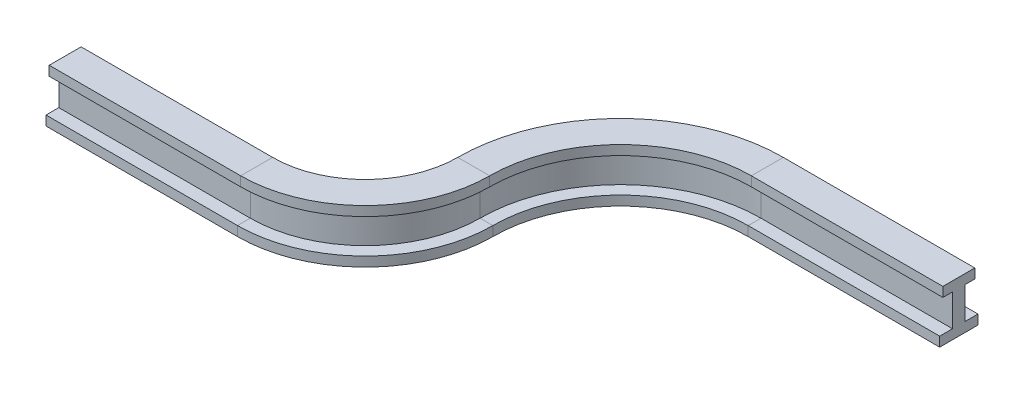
ISO-10303-21;
HEADER;
FILE_DESCRIPTION(('STEP AP214'),'2;1');
FILE_NAME('part.step','',(''),(''),'','','');
FILE_SCHEMA(('AUTOMOTIVE_DESIGN { 1 0 10303 214 1 1 1 1 }'));
ENDSEC;
DATA;
#1=APPLICATION_CONTEXT('core data for automotive mechanical design processes');
#2=APPLICATION_PROTOCOL_DEFINITION('international standard','automotive_design',2000,#1);
#3=PRODUCT_CONTEXT('',#1,'mechanical');
#4=PRODUCT('Part','Part','',(#3));
#5=PRODUCT_RELATED_PRODUCT_CATEGORY('part','',(#4));
#6=PRODUCT_DEFINITION_FORMATION('','',#4);
#7=PRODUCT_DEFINITION_CONTEXT('part definition',#1,'design');
#8=PRODUCT_DEFINITION('design','',#6,#7);
#9=PRODUCT_DEFINITION_SHAPE('','',#8);
#10=(LENGTH_UNIT() NAMED_UNIT(*) SI_UNIT(.MILLI.,.METRE.));
#11=(NAMED_UNIT(*) PLANE_ANGLE_UNIT() SI_UNIT($,.RADIAN.));
#12=(NAMED_UNIT(*) SI_UNIT($,.STERADIAN.) SOLID_ANGLE_UNIT());
#13=UNCERTAINTY_MEASURE_WITH_UNIT(LENGTH_MEASURE(1.E-05),#10,'distance_accuracy_value','');
#14=(GEOMETRIC_REPRESENTATION_CONTEXT(3) GLOBAL_UNCERTAINTY_ASSIGNED_CONTEXT((#13)) GLOBAL_UNIT_ASSIGNED_CONTEXT((#10,
#11,#12)) REPRESENTATION_CONTEXT('',''));
#15=CARTESIAN_POINT('',(0.,0.,0.));
#16=DIRECTION('',(0.,0.,1.));
#17=DIRECTION('',(1.,0.,0.));
#18=AXIS2_PLACEMENT_3D('',#15,#16,#17);
#19=CARTESIAN_POINT('',(0.,0.,0.));
#20=DIRECTION('',(-1.,0.,0.));
#21=DIRECTION('',(0.,0.,1.));
#22=AXIS2_PLACEMENT_3D('',#19,#20,#21);
#23=PLANE('',#22);
#24=DIRECTION('',(0.,0.,-1.));
#25=VECTOR('',#24,1.);
#26=CARTESIAN_POINT('',(0.,6.5,-2.));
#27=LINE('',#26,#25);
#28=CARTESIAN_POINT('',(0.,6.5,-0.499999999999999));
#29=VERTEX_POINT('',#28);
#30=CARTESIAN_POINT('',(0.,6.5,-2.));
#31=VERTEX_POINT('',#30);
#32=EDGE_CURVE('E360',#29,#31,#27,.T.);
#33=ORIENTED_EDGE('',*,*,#32,.T.);
#34=DIRECTION('',(0.,-1.,0.));
#35=VECTOR('',#34,1.);
#36=CARTESIAN_POINT('',(0.,1.5,-2.));
#37=LINE('',#36,#35);
#38=CARTESIAN_POINT('',(0.,1.5,-2.));
#39=VERTEX_POINT('',#38);
#40=EDGE_CURVE('E358',#31,#39,#37,.T.);
#41=ORIENTED_EDGE('',*,*,#40,.T.);
#42=DIRECTION('',(0.,0.,1.));
#43=VECTOR('',#42,1.);
#44=CARTESIAN_POINT('',(0.,1.5,-2.));
#45=LINE('',#44,#43);
#46=CARTESIAN_POINT('',(0.,1.5,0.));
#47=VERTEX_POINT('',#46);
#48=EDGE_CURVE('E348',#39,#47,#45,.T.);
#49=ORIENTED_EDGE('',*,*,#48,.T.);
#50=DIRECTION('',(0.,-1.,0.));
#51=VECTOR('',#50,1.);
#52=CARTESIAN_POINT('',(0.,1.5,0.));
#53=LINE('',#52,#51);
#54=CARTESIAN_POINT('',(0.,0.,0.));
#55=VERTEX_POINT('',#54);
#56=EDGE_CURVE('E341',#47,#55,#53,.T.);
#57=ORIENTED_EDGE('',*,*,#56,.T.);
#58=DIRECTION('',(0.,0.,-1.));
#59=VECTOR('',#58,1.);
#60=CARTESIAN_POINT('',(0.,0.,0.));
#61=LINE('',#60,#59);
#62=CARTESIAN_POINT('',(0.,0.,-6.));
#63=VERTEX_POINT('',#62);
#64=EDGE_CURVE('E334',#55,#63,#61,.T.);
#65=ORIENTED_EDGE('',*,*,#64,.T.);
#66=DIRECTION('',(0.,1.,0.));
#67=VECTOR('',#66,1.);
#68=CARTESIAN_POINT('',(0.,0.,-6.));
#69=LINE('',#68,#67);
#70=CARTESIAN_POINT('',(0.,1.5,-6.));
#71=VERTEX_POINT('',#70);
#72=EDGE_CURVE('E421',#63,#71,#69,.T.);
#73=ORIENTED_EDGE('',*,*,#72,.T.);
#74=DIRECTION('',(0.,0.,1.));
#75=VECTOR('',#74,1.);
#76=CARTESIAN_POINT('',(0.,1.5,-6.));
#77=LINE('',#76,#75);
#78=CARTESIAN_POINT('',(0.,1.5,-4.));
#79=VERTEX_POINT('',#78);
#80=EDGE_CURVE('E438',#71,#79,#77,.T.);
#81=ORIENTED_EDGE('',*,*,#80,.T.);
#82=DIRECTION('',(0.,1.,0.));
#83=VECTOR('',#82,1.);
#84=CARTESIAN_POINT('',(0.,6.5,-4.));
#85=LINE('',#84,#83);
#86=CARTESIAN_POINT('',(0.,6.5,-4.));
#87=VERTEX_POINT('',#86);
#88=EDGE_CURVE('E458',#79,#87,#85,.T.);
#89=ORIENTED_EDGE('',*,*,#88,.T.);
#90=DIRECTION('',(0.,0.,-1.));
#91=VECTOR('',#90,1.);
#92=CARTESIAN_POINT('',(0.,6.5,-5.5));
#93=LINE('',#92,#91);
#94=CARTESIAN_POINT('',(0.,6.5,-5.5));
#95=VERTEX_POINT('',#94);
#96=EDGE_CURVE('E193',#87,#95,#93,.T.);
#97=ORIENTED_EDGE('',*,*,#96,.T.);
#98=DIRECTION('',(0.,1.,0.));
#99=VECTOR('',#98,1.);
#100=CARTESIAN_POINT('',(0.,8.,-5.5));
#101=LINE('',#100,#99);
#102=CARTESIAN_POINT('',(0.,8.,-5.5));
#103=VERTEX_POINT('',#102);
#104=EDGE_CURVE('E185',#95,#103,#101,.T.);
#105=ORIENTED_EDGE('',*,*,#104,.T.);
#106=DIRECTION('',(0.,0.,1.));
#107=VECTOR('',#106,1.);
#108=CARTESIAN_POINT('',(0.,8.,-0.499999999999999));
#109=LINE('',#108,#107);
#110=CARTESIAN_POINT('',(0.,8.,-0.499999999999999));
#111=VERTEX_POINT('',#110);
#112=EDGE_CURVE('E178',#103,#111,#109,.T.);
#113=ORIENTED_EDGE('',*,*,#112,.T.);
#114=DIRECTION('',(0.,-1.,0.));
#115=VECTOR('',#114,1.);
#116=CARTESIAN_POINT('',(0.,6.5,-0.499999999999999));
#117=LINE('',#116,#115);
#118=EDGE_CURVE('E540',#111,#29,#117,.T.);
#119=ORIENTED_EDGE('',*,*,#118,.T.);
#120=EDGE_LOOP('',(#33,#41,#49,#57,#65,#73,#81,#89,#97,#105,#113,#119));
#121=FACE_BOUND('',#120,.T.);
#122=ADVANCED_FACE('F32',(#121),#23,.F.);
#123=CARTESIAN_POINT('',(-100.,0.,40.));
#124=DIRECTION('',(-1.,0.,0.));
#125=DIRECTION('',(0.,0.,1.));
#126=AXIS2_PLACEMENT_3D('',#123,#124,#125);
#127=PLANE('',#126);
#128=DIRECTION('',(0.,0.,-1.));
#129=VECTOR('',#128,1.);
#130=CARTESIAN_POINT('',(-100.,6.5,38.));
#131=LINE('',#130,#129);
#132=CARTESIAN_POINT('',(-100.,6.5,39.5));
#133=VERTEX_POINT('',#132);
#134=CARTESIAN_POINT('',(-100.,6.5,38.));
#135=VERTEX_POINT('',#134);
#136=EDGE_CURVE('E46',#133,#135,#131,.T.);
#137=ORIENTED_EDGE('',*,*,#136,.F.);
#138=DIRECTION('',(0.,-1.,0.));
#139=VECTOR('',#138,1.);
#140=CARTESIAN_POINT('',(-100.,6.5,39.5));
#141=LINE('',#140,#139);
#142=CARTESIAN_POINT('',(-100.,8.,39.5));
#143=VERTEX_POINT('',#142);
#144=EDGE_CURVE('E55',#143,#133,#141,.T.);
#145=ORIENTED_EDGE('',*,*,#144,.F.);
#146=DIRECTION('',(0.,0.,1.));
#147=VECTOR('',#146,1.);
#148=CARTESIAN_POINT('',(-100.,8.,39.5));
#149=LINE('',#148,#147);
#150=CARTESIAN_POINT('',(-100.,8.,34.5));
#151=VERTEX_POINT('',#150);
#152=EDGE_CURVE('E538',#151,#143,#149,.T.);
#153=ORIENTED_EDGE('',*,*,#152,.F.);
#154=DIRECTION('',(0.,1.,0.));
#155=VECTOR('',#154,1.);
#156=CARTESIAN_POINT('',(-100.,8.,34.5));
#157=LINE('',#156,#155);
#158=CARTESIAN_POINT('',(-100.,6.5,34.5));
#159=VERTEX_POINT('',#158);
#160=EDGE_CURVE('E521',#159,#151,#157,.T.);
#161=ORIENTED_EDGE('',*,*,#160,.F.);
#162=DIRECTION('',(0.,0.,-1.));
#163=VECTOR('',#162,1.);
#164=CARTESIAN_POINT('',(-100.,6.5,34.5));
#165=LINE('',#164,#163);
#166=CARTESIAN_POINT('',(-100.,6.5,36.));
#167=VERTEX_POINT('',#166);
#168=EDGE_CURVE('E501',#167,#159,#165,.T.);
#169=ORIENTED_EDGE('',*,*,#168,.F.);
#170=DIRECTION('',(0.,1.,0.));
#171=VECTOR('',#170,1.);
#172=CARTESIAN_POINT('',(-100.,6.5,36.));
#173=LINE('',#172,#171);
#174=CARTESIAN_POINT('',(-100.,1.5,36.));
#175=VERTEX_POINT('',#174);
#176=EDGE_CURVE('E211',#175,#167,#173,.T.);
#177=ORIENTED_EDGE('',*,*,#176,.F.);
#178=DIRECTION('',(0.,0.,1.));
#179=VECTOR('',#178,1.);
#180=CARTESIAN_POINT('',(-100.,1.5,34.));
#181=LINE('',#180,#179);
#182=CARTESIAN_POINT('',(-100.,1.5,34.));
#183=VERTEX_POINT('',#182);
#184=EDGE_CURVE('E219',#183,#175,#181,.T.);
#185=ORIENTED_EDGE('',*,*,#184,.F.);
#186=DIRECTION('',(0.,1.,0.));
#187=VECTOR('',#186,1.);
#188=CARTESIAN_POINT('',(-100.,0.,34.));
#189=LINE('',#188,#187);
#190=CARTESIAN_POINT('',(-100.,0.,34.));
#191=VERTEX_POINT('',#190);
#192=EDGE_CURVE('E227',#191,#183,#189,.T.);
#193=ORIENTED_EDGE('',*,*,#192,.F.);
#194=DIRECTION('',(0.,0.,-1.));
#195=VECTOR('',#194,1.);
#196=CARTESIAN_POINT('',(-100.,0.,40.));
#197=LINE('',#196,#195);
#198=CARTESIAN_POINT('',(-100.,0.,40.));
#199=VERTEX_POINT('',#198);
#200=EDGE_CURVE('E419',#199,#191,#197,.T.);
#201=ORIENTED_EDGE('',*,*,#200,.F.);
#202=DIRECTION('',(0.,-1.,0.));
#203=VECTOR('',#202,1.);
#204=CARTESIAN_POINT('',(-100.,1.5,40.));
#205=LINE('',#204,#203);
#206=CARTESIAN_POINT('',(-100.,1.5,40.));
#207=VERTEX_POINT('',#206);
#208=EDGE_CURVE('E398',#207,#199,#205,.T.);
#209=ORIENTED_EDGE('',*,*,#208,.F.);
#210=DIRECTION('',(0.,0.,1.));
#211=VECTOR('',#210,1.);
#212=CARTESIAN_POINT('',(-100.,1.5,38.));
#213=LINE('',#212,#211);
#214=CARTESIAN_POINT('',(-100.,1.5,38.));
#215=VERTEX_POINT('',#214);
#216=EDGE_CURVE('E392',#215,#207,#213,.T.);
#217=ORIENTED_EDGE('',*,*,#216,.F.);
#218=DIRECTION('',(0.,-1.,0.));
#219=VECTOR('',#218,1.);
#220=CARTESIAN_POINT('',(-100.,1.5,38.));
#221=LINE('',#220,#219);
#222=EDGE_CURVE('E11',#135,#215,#221,.T.);
#223=ORIENTED_EDGE('',*,*,#222,.F.);
#224=EDGE_LOOP('',(#137,#145,#153,#161,#169,#177,#185,#193,#201,#209,#217,#223));
#225=FACE_BOUND('',#224,.T.);
#226=ADVANCED_FACE('F633',(#225),#127,.T.);
#227=CARTESIAN_POINT('',(0.,1.5,-2.));
#228=DIRECTION('',(0.,-1.,0.));
#229=DIRECTION('',(0.,0.,-1.));
#230=AXIS2_PLACEMENT_3D('',#227,#228,#229);
#231=PLANE('',#230);
#232=DIRECTION('',(-1.,0.,0.));
#233=VECTOR('',#232,1.);
#234=CARTESIAN_POINT('',(0.,1.5,0.));
#235=LINE('',#234,#233);
#236=CARTESIAN_POINT('',(-30.,1.5,0.));
#237=VERTEX_POINT('',#236);
#238=EDGE_CURVE('E354',#47,#237,#235,.T.);
#239=ORIENTED_EDGE('',*,*,#238,.F.);
#240=ORIENTED_EDGE('',*,*,#48,.F.);
#241=DIRECTION('',(-1.,0.,0.));
#242=VECTOR('',#241,1.);
#243=CARTESIAN_POINT('',(0.,1.5,-2.));
#244=LINE('',#243,#242);
#245=CARTESIAN_POINT('',(-30.,1.5,-2.));
#246=VERTEX_POINT('',#245);
#247=EDGE_CURVE('E353',#39,#246,#244,.T.);
#248=ORIENTED_EDGE('',*,*,#247,.T.);
#249=DIRECTION('',(0.,0.,1.));
#250=VECTOR('',#249,1.);
#251=CARTESIAN_POINT('',(-30.,1.5,-2.));
#252=LINE('',#251,#250);
#253=EDGE_CURVE('E369',#246,#237,#252,.T.);
#254=ORIENTED_EDGE('',*,*,#253,.T.);
#255=EDGE_LOOP('',(#239,#240,#248,#254));
#256=FACE_BOUND('',#255,.T.);
#257=ADVANCED_FACE('F350',(#256),#231,.F.);
#258=CARTESIAN_POINT('',(0.,1.5,0.));
#259=DIRECTION('',(0.,0.,-1.));
#260=DIRECTION('',(0.,1.,0.));
#261=AXIS2_PLACEMENT_3D('',#258,#259,#260);
#262=PLANE('',#261);
#263=DIRECTION('',(-1.,0.,0.));
#264=VECTOR('',#263,1.);
#265=CARTESIAN_POINT('',(0.,0.,0.));
#266=LINE('',#265,#264);
#267=CARTESIAN_POINT('',(-30.,0.,0.));
#268=VERTEX_POINT('',#267);
#269=EDGE_CURVE('E406',#55,#268,#266,.T.);
#270=ORIENTED_EDGE('',*,*,#269,.F.);
#271=ORIENTED_EDGE('',*,*,#56,.F.);
#272=ORIENTED_EDGE('',*,*,#238,.T.);
#273=DIRECTION('',(0.,-1.,0.));
#274=VECTOR('',#273,1.);
#275=CARTESIAN_POINT('',(-30.,1.5,0.));
#276=LINE('',#275,#274);
#277=EDGE_CURVE('E403',#237,#268,#276,.T.);
#278=ORIENTED_EDGE('',*,*,#277,.T.);
#279=EDGE_LOOP('',(#270,#271,#272,#278));
#280=FACE_BOUND('',#279,.T.);
#281=ADVANCED_FACE('F640',(#280),#262,.F.);
#282=CARTESIAN_POINT('',(0.,0.,0.));
#283=DIRECTION('',(0.,1.,0.));
#284=DIRECTION('',(0.,0.,1.));
#285=AXIS2_PLACEMENT_3D('',#282,#283,#284);
#286=PLANE('',#285);
#287=DIRECTION('',(-1.,0.,0.));
#288=VECTOR('',#287,1.);
#289=CARTESIAN_POINT('',(0.,0.,-6.));
#290=LINE('',#289,#288);
#291=CARTESIAN_POINT('',(-30.,0.,-6.));
#292=VERTEX_POINT('',#291);
#293=EDGE_CURVE('E424',#63,#292,#290,.T.);
#294=ORIENTED_EDGE('',*,*,#293,.F.);
#295=ORIENTED_EDGE('',*,*,#64,.F.);
#296=ORIENTED_EDGE('',*,*,#269,.T.);
#297=DIRECTION('',(0.,0.,-1.));
#298=VECTOR('',#297,1.);
#299=CARTESIAN_POINT('',(-30.,0.,0.));
#300=LINE('',#299,#298);
#301=EDGE_CURVE('E408',#268,#292,#300,.T.);
#302=ORIENTED_EDGE('',*,*,#301,.T.);
#303=EDGE_LOOP('',(#294,#295,#296,#302));
#304=FACE_BOUND('',#303,.T.);
#305=ADVANCED_FACE('F651',(#304),#286,.F.);
#306=CARTESIAN_POINT('',(0.,0.,-6.));
#307=DIRECTION('',(0.,0.,1.));
#308=DIRECTION('',(1.,0.,0.));
#309=AXIS2_PLACEMENT_3D('',#306,#307,#308);
#310=PLANE('',#309);
#311=DIRECTION('',(-1.,0.,0.));
#312=VECTOR('',#311,1.);
#313=CARTESIAN_POINT('',(0.,1.5,-6.));
#314=LINE('',#313,#312);
#315=CARTESIAN_POINT('',(-30.,1.5,-6.));
#316=VERTEX_POINT('',#315);
#317=EDGE_CURVE('E441',#71,#316,#314,.T.);
#318=ORIENTED_EDGE('',*,*,#317,.F.);
#319=ORIENTED_EDGE('',*,*,#72,.F.);
#320=ORIENTED_EDGE('',*,*,#293,.T.);
#321=DIRECTION('',(0.,1.,0.));
#322=VECTOR('',#321,1.);
#323=CARTESIAN_POINT('',(-30.,0.,-6.));
#324=LINE('',#323,#322);
#325=EDGE_CURVE('E427',#292,#316,#324,.T.);
#326=ORIENTED_EDGE('',*,*,#325,.T.);
#327=EDGE_LOOP('',(#318,#319,#320,#326));
#328=FACE_BOUND('',#327,.T.);
#329=ADVANCED_FACE('F656',(#328),#310,.F.);
#330=CARTESIAN_POINT('',(0.,1.5,-6.));
#331=DIRECTION('',(0.,-1.,0.));
#332=DIRECTION('',(0.,0.,-1.));
#333=AXIS2_PLACEMENT_3D('',#330,#331,#332);
#334=PLANE('',#333);
#335=DIRECTION('',(-1.,0.,0.));
#336=VECTOR('',#335,1.);
#337=CARTESIAN_POINT('',(0.,1.5,-4.));
#338=LINE('',#337,#336);
#339=CARTESIAN_POINT('',(-30.,1.5,-4.));
#340=VERTEX_POINT('',#339);
#341=EDGE_CURVE('E461',#79,#340,#338,.T.);
#342=ORIENTED_EDGE('',*,*,#341,.F.);
#343=ORIENTED_EDGE('',*,*,#80,.F.);
#344=ORIENTED_EDGE('',*,*,#317,.T.);
#345=DIRECTION('',(0.,0.,1.));
#346=VECTOR('',#345,1.);
#347=CARTESIAN_POINT('',(-30.,1.5,-6.));
#348=LINE('',#347,#346);
#349=EDGE_CURVE('E444',#316,#340,#348,.T.);
#350=ORIENTED_EDGE('',*,*,#349,.T.);
#351=EDGE_LOOP('',(#342,#343,#344,#350));
#352=FACE_BOUND('',#351,.T.);
#353=ADVANCED_FACE('F681',(#352),#334,.F.);
#354=CARTESIAN_POINT('',(0.,6.5,-4.));
#355=DIRECTION('',(0.,0.,1.));
#356=DIRECTION('',(1.,0.,0.));
#357=AXIS2_PLACEMENT_3D('',#354,#355,#356);
#358=PLANE('',#357);
#359=DIRECTION('',(-1.,0.,0.));
#360=VECTOR('',#359,1.);
#361=CARTESIAN_POINT('',(0.,6.5,-4.));
#362=LINE('',#361,#360);
#363=CARTESIAN_POINT('',(-30.,6.5,-4.));
#364=VERTEX_POINT('',#363);
#365=EDGE_CURVE('E482',#87,#364,#362,.T.);
#366=ORIENTED_EDGE('',*,*,#365,.F.);
#367=ORIENTED_EDGE('',*,*,#88,.F.);
#368=ORIENTED_EDGE('',*,*,#341,.T.);
#369=DIRECTION('',(0.,1.,0.));
#370=VECTOR('',#369,1.);
#371=CARTESIAN_POINT('',(-30.,6.5,-4.));
#372=LINE('',#371,#370);
#373=EDGE_CURVE('E464',#340,#364,#372,.T.);
#374=ORIENTED_EDGE('',*,*,#373,.T.);
#375=EDGE_LOOP('',(#366,#367,#368,#374));
#376=FACE_BOUND('',#375,.T.);
#377=ADVANCED_FACE('F695',(#376),#358,.F.);
#378=CARTESIAN_POINT('',(0.,6.5,-5.5));
#379=DIRECTION('',(0.,1.,0.));
#380=DIRECTION('',(0.,0.,1.));
#381=AXIS2_PLACEMENT_3D('',#378,#379,#380);
#382=PLANE('',#381);
#383=DIRECTION('',(-1.,0.,0.));
#384=VECTOR('',#383,1.);
#385=CARTESIAN_POINT('',(0.,6.5,-5.5));
#386=LINE('',#385,#384);
#387=CARTESIAN_POINT('',(-30.,6.5,-5.5));
#388=VERTEX_POINT('',#387);
#389=EDGE_CURVE('E505',#95,#388,#386,.T.);
#390=ORIENTED_EDGE('',*,*,#389,.F.);
#391=ORIENTED_EDGE('',*,*,#96,.F.);
#392=ORIENTED_EDGE('',*,*,#365,.T.);
#393=DIRECTION('',(0.,0.,-1.));
#394=VECTOR('',#393,1.);
#395=CARTESIAN_POINT('',(-30.,6.5,-5.5));
#396=LINE('',#395,#394);
#397=EDGE_CURVE('E484',#364,#388,#396,.T.);
#398=ORIENTED_EDGE('',*,*,#397,.T.);
#399=EDGE_LOOP('',(#390,#391,#392,#398));
#400=FACE_BOUND('',#399,.T.);
#401=ADVANCED_FACE('F710',(#400),#382,.F.);
#402=CARTESIAN_POINT('',(0.,8.,-5.5));
#403=DIRECTION('',(0.,0.,1.));
#404=DIRECTION('',(1.,0.,0.));
#405=AXIS2_PLACEMENT_3D('',#402,#403,#404);
#406=PLANE('',#405);
#407=DIRECTION('',(-1.,0.,0.));
#408=VECTOR('',#407,1.);
#409=CARTESIAN_POINT('',(0.,8.,-5.5));
#410=LINE('',#409,#408);
#411=CARTESIAN_POINT('',(-30.,8.,-5.5));
#412=VERTEX_POINT('',#411);
#413=EDGE_CURVE('E525',#103,#412,#410,.T.);
#414=ORIENTED_EDGE('',*,*,#413,.F.);
#415=ORIENTED_EDGE('',*,*,#104,.F.);
#416=ORIENTED_EDGE('',*,*,#389,.T.);
#417=DIRECTION('',(0.,1.,0.));
#418=VECTOR('',#417,1.);
#419=CARTESIAN_POINT('',(-30.,8.,-5.5));
#420=LINE('',#419,#418);
#421=EDGE_CURVE('E507',#388,#412,#420,.T.);
#422=ORIENTED_EDGE('',*,*,#421,.T.);
#423=EDGE_LOOP('',(#414,#415,#416,#422));
#424=FACE_BOUND('',#423,.T.);
#425=ADVANCED_FACE('F725',(#424),#406,.F.);
#426=CARTESIAN_POINT('',(0.,8.,-0.499999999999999));
#427=DIRECTION('',(0.,-1.,0.));
#428=DIRECTION('',(0.,0.,-1.));
#429=AXIS2_PLACEMENT_3D('',#426,#427,#428);
#430=PLANE('',#429);
#431=DIRECTION('',(-1.,0.,0.));
#432=VECTOR('',#431,1.);
#433=CARTESIAN_POINT('',(0.,8.,-0.499999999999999));
#434=LINE('',#433,#432);
#435=CARTESIAN_POINT('',(-30.,8.,-0.499999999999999));
#436=VERTEX_POINT('',#435);
#437=EDGE_CURVE('E543',#111,#436,#434,.T.);
#438=ORIENTED_EDGE('',*,*,#437,.F.);
#439=ORIENTED_EDGE('',*,*,#112,.F.);
#440=ORIENTED_EDGE('',*,*,#413,.T.);
#441=DIRECTION('',(0.,0.,1.));
#442=VECTOR('',#441,1.);
#443=CARTESIAN_POINT('',(-30.,8.,-0.499999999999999));
#444=LINE('',#443,#442);
#445=EDGE_CURVE('E527',#412,#436,#444,.T.);
#446=ORIENTED_EDGE('',*,*,#445,.T.);
#447=EDGE_LOOP('',(#438,#439,#440,#446));
#448=FACE_BOUND('',#447,.T.);
#449=ADVANCED_FACE('F739',(#448),#430,.F.);
#450=CARTESIAN_POINT('',(0.,6.5,-0.499999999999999));
#451=DIRECTION('',(0.,0.,-1.));
#452=DIRECTION('',(-1.,0.,0.));
#453=AXIS2_PLACEMENT_3D('',#450,#451,#452);
#454=PLANE('',#453);
#455=DIRECTION('',(-1.,0.,0.));
#456=VECTOR('',#455,1.);
#457=CARTESIAN_POINT('',(0.,6.5,-0.499999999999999));
#458=LINE('',#457,#456);
#459=CARTESIAN_POINT('',(-30.,6.5,-0.499999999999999));
#460=VERTEX_POINT('',#459);
#461=EDGE_CURVE('E558',#29,#460,#458,.T.);
#462=ORIENTED_EDGE('',*,*,#461,.F.);
#463=ORIENTED_EDGE('',*,*,#118,.F.);
#464=ORIENTED_EDGE('',*,*,#437,.T.);
#465=DIRECTION('',(0.,-1.,0.));
#466=VECTOR('',#465,1.);
#467=CARTESIAN_POINT('',(-30.,6.5,-0.499999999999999));
#468=LINE('',#467,#466);
#469=EDGE_CURVE('E546',#436,#460,#468,.T.);
#470=ORIENTED_EDGE('',*,*,#469,.T.);
#471=EDGE_LOOP('',(#462,#463,#464,#470));
#472=FACE_BOUND('',#471,.T.);
#473=ADVANCED_FACE('F751',(#472),#454,.F.);
#474=CARTESIAN_POINT('',(0.,6.5,-2.));
#475=DIRECTION('',(0.,1.,0.));
#476=DIRECTION('',(0.,0.,1.));
#477=AXIS2_PLACEMENT_3D('',#474,#475,#476);
#478=PLANE('',#477);
#479=DIRECTION('',(-1.,0.,0.));
#480=VECTOR('',#479,1.);
#481=CARTESIAN_POINT('',(0.,6.5,-2.));
#482=LINE('',#481,#480);
#483=CARTESIAN_POINT('',(-30.,6.5,-2.));
#484=VERTEX_POINT('',#483);
#485=EDGE_CURVE('E576',#31,#484,#482,.T.);
#486=ORIENTED_EDGE('',*,*,#485,.F.);
#487=ORIENTED_EDGE('',*,*,#32,.F.);
#488=ORIENTED_EDGE('',*,*,#461,.T.);
#489=DIRECTION('',(0.,0.,-1.));
#490=VECTOR('',#489,1.);
#491=CARTESIAN_POINT('',(-30.,6.5,-2.));
#492=LINE('',#491,#490);
#493=EDGE_CURVE('E561',#460,#484,#492,.T.);
#494=ORIENTED_EDGE('',*,*,#493,.T.);
#495=EDGE_LOOP('',(#486,#487,#488,#494));
#496=FACE_BOUND('',#495,.T.);
#497=ADVANCED_FACE('F629',(#496),#478,.F.);
#498=CARTESIAN_POINT('',(0.,1.5,-2.));
#499=DIRECTION('',(0.,0.,-1.));
#500=DIRECTION('',(-1.,0.,0.));
#501=AXIS2_PLACEMENT_3D('',#498,#499,#500);
#502=PLANE('',#501);
#503=DIRECTION('',(0.,-1.,0.));
#504=VECTOR('',#503,1.);
#505=CARTESIAN_POINT('',(-30.,1.5,-2.));
#506=LINE('',#505,#504);
#507=EDGE_CURVE('E368',#484,#246,#506,.T.);
#508=ORIENTED_EDGE('',*,*,#507,.T.);
#509=ORIENTED_EDGE('',*,*,#247,.F.);
#510=ORIENTED_EDGE('',*,*,#40,.F.);
#511=ORIENTED_EDGE('',*,*,#485,.T.);
#512=EDGE_LOOP('',(#508,#509,#510,#511));
#513=FACE_BOUND('',#512,.T.);
#514=ADVANCED_FACE('F366',(#513),#502,.F.);
#515=CARTESIAN_POINT('',(-30.,1.5,-2.));
#516=DIRECTION('',(0.,-1.,0.));
#517=DIRECTION('',(0.,0.,-1.));
#518=AXIS2_PLACEMENT_3D('',#515,#516,#517);
#519=PLANE('',#518);
#520=CARTESIAN_POINT('',(-30.,1.5,20.));
#521=DIRECTION('',(0.,1.,0.));
#522=DIRECTION('',(0.,0.,-1.));
#523=AXIS2_PLACEMENT_3D('',#520,#521,#522);
#524=CIRCLE('',#523,20.);
#525=CARTESIAN_POINT('',(-50.,1.5,20.));
#526=VERTEX_POINT('',#525);
#527=EDGE_CURVE('E316',#237,#526,#524,.T.);
#528=ORIENTED_EDGE('',*,*,#527,.F.);
#529=ORIENTED_EDGE('',*,*,#253,.F.);
#530=CARTESIAN_POINT('',(-30.,1.5,20.));
#531=DIRECTION('',(0.,1.,0.));
#532=DIRECTION('',(0.,0.,-1.));
#533=AXIS2_PLACEMENT_3D('',#530,#531,#532);
#534=CIRCLE('',#533,22.);
#535=CARTESIAN_POINT('',(-52.,1.5,20.));
#536=VERTEX_POINT('',#535);
#537=EDGE_CURVE('E376',#246,#536,#534,.T.);
#538=ORIENTED_EDGE('',*,*,#537,.T.);
#539=DIRECTION('',(1.,0.,0.));
#540=VECTOR('',#539,1.);
#541=CARTESIAN_POINT('',(-52.,1.5,20.));
#542=LINE('',#541,#540);
#543=EDGE_CURVE('E374',#536,#526,#542,.T.);
#544=ORIENTED_EDGE('',*,*,#543,.T.);
#545=EDGE_LOOP('',(#528,#529,#538,#544));
#546=FACE_BOUND('',#545,.T.);
#547=ADVANCED_FACE('F604',(#546),#519,.F.);
#548=CARTESIAN_POINT('',(-30.,0.,20.));
#549=DIRECTION('',(0.,1.,0.));
#550=DIRECTION('',(0.,0.,1.));
#551=AXIS2_PLACEMENT_3D('',#548,#549,#550);
#552=CYLINDRICAL_SURFACE('',#551,20.);
#553=CARTESIAN_POINT('',(-30.,0.,20.));
#554=DIRECTION('',(0.,1.,0.));
#555=DIRECTION('',(0.,0.,-1.));
#556=AXIS2_PLACEMENT_3D('',#553,#554,#555);
#557=CIRCLE('',#556,20.);
#558=CARTESIAN_POINT('',(-50.,0.,20.));
#559=VERTEX_POINT('',#558);
#560=EDGE_CURVE('E309',#268,#559,#557,.T.);
#561=ORIENTED_EDGE('',*,*,#560,.F.);
#562=ORIENTED_EDGE('',*,*,#277,.F.);
#563=ORIENTED_EDGE('',*,*,#527,.T.);
#564=DIRECTION('',(0.,-1.,0.));
#565=VECTOR('',#564,1.);
#566=CARTESIAN_POINT('',(-50.,1.5,20.));
#567=LINE('',#566,#565);
#568=EDGE_CURVE('E378',#526,#559,#567,.T.);
#569=ORIENTED_EDGE('',*,*,#568,.T.);
#570=EDGE_LOOP('',(#561,#562,#563,#569));
#571=FACE_BOUND('',#570,.T.);
#572=ADVANCED_FACE('F649',(#571),#552,.F.);
#573=CARTESIAN_POINT('',(-30.,0.,0.));
#574=DIRECTION('',(0.,1.,0.));
#575=DIRECTION('',(0.,0.,1.));
#576=AXIS2_PLACEMENT_3D('',#573,#574,#575);
#577=PLANE('',#576);
#578=CARTESIAN_POINT('',(-30.,0.,20.));
#579=DIRECTION('',(0.,1.,0.));
#580=DIRECTION('',(0.,0.,-1.));
#581=AXIS2_PLACEMENT_3D('',#578,#579,#580);
#582=CIRCLE('',#581,26.);
#583=CARTESIAN_POINT('',(-56.,0.,20.));
#584=VERTEX_POINT('',#583);
#585=EDGE_CURVE('E301',#292,#584,#582,.T.);
#586=ORIENTED_EDGE('',*,*,#585,.F.);
#587=ORIENTED_EDGE('',*,*,#301,.F.);
#588=ORIENTED_EDGE('',*,*,#560,.T.);
#589=DIRECTION('',(-1.,0.,0.));
#590=VECTOR('',#589,1.);
#591=CARTESIAN_POINT('',(-50.,0.,20.));
#592=LINE('',#591,#590);
#593=EDGE_CURVE('E411',#559,#584,#592,.T.);
#594=ORIENTED_EDGE('',*,*,#593,.T.);
#595=EDGE_LOOP('',(#586,#587,#588,#594));
#596=FACE_BOUND('',#595,.T.);
#597=ADVANCED_FACE('F663',(#596),#577,.F.);
#598=CARTESIAN_POINT('',(-30.,0.,20.));
#599=DIRECTION('',(0.,1.,0.));
#600=DIRECTION('',(0.,0.,1.));
#601=AXIS2_PLACEMENT_3D('',#598,#599,#600);
#602=CYLINDRICAL_SURFACE('',#601,26.);
#603=CARTESIAN_POINT('',(-30.,1.5,20.));
#604=DIRECTION('',(0.,1.,0.));
#605=DIRECTION('',(0.,0.,-1.));
#606=AXIS2_PLACEMENT_3D('',#603,#604,#605);
#607=CIRCLE('',#606,26.);
#608=CARTESIAN_POINT('',(-56.,1.5,20.));
#609=VERTEX_POINT('',#608);
#610=EDGE_CURVE('E447',#316,#609,#607,.T.);
#611=ORIENTED_EDGE('',*,*,#610,.F.);
#612=ORIENTED_EDGE('',*,*,#325,.F.);
#613=ORIENTED_EDGE('',*,*,#585,.T.);
#614=DIRECTION('',(0.,1.,0.));
#615=VECTOR('',#614,1.);
#616=CARTESIAN_POINT('',(-56.,0.,20.));
#617=LINE('',#616,#615);
#618=EDGE_CURVE('E430',#584,#609,#617,.T.);
#619=ORIENTED_EDGE('',*,*,#618,.T.);
#620=EDGE_LOOP('',(#611,#612,#613,#619));
#621=FACE_BOUND('',#620,.T.);
#622=ADVANCED_FACE('F672',(#621),#602,.T.);
#623=CARTESIAN_POINT('',(-30.,1.5,-6.));
#624=DIRECTION('',(0.,-1.,0.));
#625=DIRECTION('',(0.,0.,-1.));
#626=AXIS2_PLACEMENT_3D('',#623,#624,#625);
#627=PLANE('',#626);
#628=CARTESIAN_POINT('',(-30.,1.5,20.));
#629=DIRECTION('',(0.,1.,0.));
#630=DIRECTION('',(0.,0.,-1.));
#631=AXIS2_PLACEMENT_3D('',#628,#629,#630);
#632=CIRCLE('',#631,24.);
#633=CARTESIAN_POINT('',(-54.,1.5,20.));
#634=VERTEX_POINT('',#633);
#635=EDGE_CURVE('E467',#340,#634,#632,.T.);
#636=ORIENTED_EDGE('',*,*,#635,.F.);
#637=ORIENTED_EDGE('',*,*,#349,.F.);
#638=ORIENTED_EDGE('',*,*,#610,.T.);
#639=DIRECTION('',(1.,0.,0.));
#640=VECTOR('',#639,1.);
#641=CARTESIAN_POINT('',(-56.,1.5,20.));
#642=LINE('',#641,#640);
#643=EDGE_CURVE('E450',#609,#634,#642,.T.);
#644=ORIENTED_EDGE('',*,*,#643,.T.);
#645=EDGE_LOOP('',(#636,#637,#638,#644));
#646=FACE_BOUND('',#645,.T.);
#647=ADVANCED_FACE('F685',(#646),#627,.F.);
#648=CARTESIAN_POINT('',(-30.,0.,20.));
#649=DIRECTION('',(0.,1.,0.));
#650=DIRECTION('',(0.,0.,1.));
#651=AXIS2_PLACEMENT_3D('',#648,#649,#650);
#652=CYLINDRICAL_SURFACE('',#651,24.);
#653=CARTESIAN_POINT('',(-30.,6.5,20.));
#654=DIRECTION('',(0.,1.,0.));
#655=DIRECTION('',(0.,0.,-1.));
#656=AXIS2_PLACEMENT_3D('',#653,#654,#655);
#657=CIRCLE('',#656,24.);
#658=CARTESIAN_POINT('',(-54.,6.5,20.));
#659=VERTEX_POINT('',#658);
#660=EDGE_CURVE('E487',#364,#659,#657,.T.);
#661=ORIENTED_EDGE('',*,*,#660,.F.);
#662=ORIENTED_EDGE('',*,*,#373,.F.);
#663=ORIENTED_EDGE('',*,*,#635,.T.);
#664=DIRECTION('',(0.,1.,0.));
#665=VECTOR('',#664,1.);
#666=CARTESIAN_POINT('',(-54.,6.5,20.));
#667=LINE('',#666,#665);
#668=EDGE_CURVE('E470',#634,#659,#667,.T.);
#669=ORIENTED_EDGE('',*,*,#668,.T.);
#670=EDGE_LOOP('',(#661,#662,#663,#669));
#671=FACE_BOUND('',#670,.T.);
#672=ADVANCED_FACE('F699',(#671),#652,.T.);
#673=CARTESIAN_POINT('',(-30.,6.5,-5.5));
#674=DIRECTION('',(0.,1.,0.));
#675=DIRECTION('',(0.,0.,1.));
#676=AXIS2_PLACEMENT_3D('',#673,#674,#675);
#677=PLANE('',#676);
#678=CARTESIAN_POINT('',(-30.,6.5,20.));
#679=DIRECTION('',(0.,1.,0.));
#680=DIRECTION('',(0.,0.,-1.));
#681=AXIS2_PLACEMENT_3D('',#678,#679,#680);
#682=CIRCLE('',#681,25.5);
#683=CARTESIAN_POINT('',(-55.5,6.5,20.));
#684=VERTEX_POINT('',#683);
#685=EDGE_CURVE('E160',#388,#684,#682,.T.);
#686=ORIENTED_EDGE('',*,*,#685,.F.);
#687=ORIENTED_EDGE('',*,*,#397,.F.);
#688=ORIENTED_EDGE('',*,*,#660,.T.);
#689=DIRECTION('',(-1.,0.,0.));
#690=VECTOR('',#689,1.);
#691=CARTESIAN_POINT('',(-55.5,6.5,20.));
#692=LINE('',#691,#690);
#693=EDGE_CURVE('E490',#659,#684,#692,.T.);
#694=ORIENTED_EDGE('',*,*,#693,.T.);
#695=EDGE_LOOP('',(#686,#687,#688,#694));
#696=FACE_BOUND('',#695,.T.);
#697=ADVANCED_FACE('F714',(#696),#677,.F.);
#698=CARTESIAN_POINT('',(-30.,0.,20.));
#699=DIRECTION('',(0.,1.,0.));
#700=DIRECTION('',(0.,0.,1.));
#701=AXIS2_PLACEMENT_3D('',#698,#699,#700);
#702=CYLINDRICAL_SURFACE('',#701,25.5);
#703=CARTESIAN_POINT('',(-30.,8.,20.));
#704=DIRECTION('',(0.,1.,0.));
#705=DIRECTION('',(0.,0.,-1.));
#706=AXIS2_PLACEMENT_3D('',#703,#704,#705);
#707=CIRCLE('',#706,25.5);
#708=CARTESIAN_POINT('',(-55.5,8.,20.));
#709=VERTEX_POINT('',#708);
#710=EDGE_CURVE('E152',#412,#709,#707,.T.);
#711=ORIENTED_EDGE('',*,*,#710,.F.);
#712=ORIENTED_EDGE('',*,*,#421,.F.);
#713=ORIENTED_EDGE('',*,*,#685,.T.);
#714=DIRECTION('',(0.,1.,0.));
#715=VECTOR('',#714,1.);
#716=CARTESIAN_POINT('',(-55.5,8.,20.));
#717=LINE('',#716,#715);
#718=EDGE_CURVE('E510',#684,#709,#717,.T.);
#719=ORIENTED_EDGE('',*,*,#718,.T.);
#720=EDGE_LOOP('',(#711,#712,#713,#719));
#721=FACE_BOUND('',#720,.T.);
#722=ADVANCED_FACE('F728',(#721),#702,.T.);
#723=CARTESIAN_POINT('',(-30.,8.,-0.499999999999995));
#724=DIRECTION('',(0.,-1.,0.));
#725=DIRECTION('',(0.,0.,-1.));
#726=AXIS2_PLACEMENT_3D('',#723,#724,#725);
#727=PLANE('',#726);
#728=CARTESIAN_POINT('',(-30.,8.,20.));
#729=DIRECTION('',(0.,1.,0.));
#730=DIRECTION('',(0.,0.,-1.));
#731=AXIS2_PLACEMENT_3D('',#728,#729,#730);
#732=CIRCLE('',#731,20.5);
#733=CARTESIAN_POINT('',(-50.5,8.,20.));
#734=VERTEX_POINT('',#733);
#735=EDGE_CURVE('E144',#436,#734,#732,.T.);
#736=ORIENTED_EDGE('',*,*,#735,.F.);
#737=ORIENTED_EDGE('',*,*,#445,.F.);
#738=ORIENTED_EDGE('',*,*,#710,.T.);
#739=DIRECTION('',(1.,0.,0.));
#740=VECTOR('',#739,1.);
#741=CARTESIAN_POINT('',(-50.5,8.,20.));
#742=LINE('',#741,#740);
#743=EDGE_CURVE('E530',#709,#734,#742,.T.);
#744=ORIENTED_EDGE('',*,*,#743,.T.);
#745=EDGE_LOOP('',(#736,#737,#738,#744));
#746=FACE_BOUND('',#745,.T.);
#747=ADVANCED_FACE('F742',(#746),#727,.F.);
#748=CARTESIAN_POINT('',(-30.,0.,20.));
#749=DIRECTION('',(0.,1.,0.));
#750=DIRECTION('',(0.,0.,1.));
#751=AXIS2_PLACEMENT_3D('',#748,#749,#750);
#752=CYLINDRICAL_SURFACE('',#751,20.5);
#753=CARTESIAN_POINT('',(-30.,6.5,20.));
#754=DIRECTION('',(0.,1.,0.));
#755=DIRECTION('',(0.,0.,-1.));
#756=AXIS2_PLACEMENT_3D('',#753,#754,#755);
#757=CIRCLE('',#756,20.5);
#758=CARTESIAN_POINT('',(-50.5,6.5,20.));
#759=VERTEX_POINT('',#758);
#760=EDGE_CURVE('E564',#460,#759,#757,.T.);
#761=ORIENTED_EDGE('',*,*,#760,.F.);
#762=ORIENTED_EDGE('',*,*,#469,.F.);
#763=ORIENTED_EDGE('',*,*,#735,.T.);
#764=DIRECTION('',(0.,-1.,0.));
#765=VECTOR('',#764,1.);
#766=CARTESIAN_POINT('',(-50.5,6.5,20.));
#767=LINE('',#766,#765);
#768=EDGE_CURVE('E549',#734,#759,#767,.T.);
#769=ORIENTED_EDGE('',*,*,#768,.T.);
#770=EDGE_LOOP('',(#761,#762,#763,#769));
#771=FACE_BOUND('',#770,.T.);
#772=ADVANCED_FACE('F754',(#771),#752,.F.);
#773=CARTESIAN_POINT('',(-30.,6.5,-2.));
#774=DIRECTION('',(0.,1.,0.));
#775=DIRECTION('',(0.,0.,1.));
#776=AXIS2_PLACEMENT_3D('',#773,#774,#775);
#777=PLANE('',#776);
#778=CARTESIAN_POINT('',(-30.,6.5,20.));
#779=DIRECTION('',(0.,1.,0.));
#780=DIRECTION('',(0.,0.,-1.));
#781=AXIS2_PLACEMENT_3D('',#778,#779,#780);
#782=CIRCLE('',#781,22.);
#783=CARTESIAN_POINT('',(-52.,6.5,20.));
#784=VERTEX_POINT('',#783);
#785=EDGE_CURVE('E580',#484,#784,#782,.T.);
#786=ORIENTED_EDGE('',*,*,#785,.F.);
#787=ORIENTED_EDGE('',*,*,#493,.F.);
#788=ORIENTED_EDGE('',*,*,#760,.T.);
#789=DIRECTION('',(-1.,0.,0.));
#790=VECTOR('',#789,1.);
#791=CARTESIAN_POINT('',(-52.,6.5,20.));
#792=LINE('',#791,#790);
#793=EDGE_CURVE('E567',#759,#784,#792,.T.);
#794=ORIENTED_EDGE('',*,*,#793,.T.);
#795=EDGE_LOOP('',(#786,#787,#788,#794));
#796=FACE_BOUND('',#795,.T.);
#797=ADVANCED_FACE('F609',(#796),#777,.F.);
#798=CARTESIAN_POINT('',(-30.,0.,20.));
#799=DIRECTION('',(0.,1.,0.));
#800=DIRECTION('',(0.,0.,1.));
#801=AXIS2_PLACEMENT_3D('',#798,#799,#800);
#802=CYLINDRICAL_SURFACE('',#801,22.);
#803=DIRECTION('',(0.,-1.,0.));
#804=VECTOR('',#803,1.);
#805=CARTESIAN_POINT('',(-52.,1.5,20.));
#806=LINE('',#805,#804);
#807=EDGE_CURVE('E391',#784,#536,#806,.T.);
#808=ORIENTED_EDGE('',*,*,#807,.T.);
#809=ORIENTED_EDGE('',*,*,#537,.F.);
#810=ORIENTED_EDGE('',*,*,#507,.F.);
#811=ORIENTED_EDGE('',*,*,#785,.T.);
#812=EDGE_LOOP('',(#808,#809,#810,#811));
#813=FACE_BOUND('',#812,.T.);
#814=ADVANCED_FACE('F606',(#813),#802,.F.);
#815=CARTESIAN_POINT('',(-52.,1.5,20.));
#816=DIRECTION('',(0.,-1.,0.));
#817=DIRECTION('',(0.,0.,-1.));
#818=AXIS2_PLACEMENT_3D('',#815,#816,#817);
#819=PLANE('',#818);
#820=CARTESIAN_POINT('',(-70.,1.5,20.));
#821=DIRECTION('',(0.,-1.,0.));
#822=DIRECTION('',(1.,0.,0.));
#823=AXIS2_PLACEMENT_3D('',#820,#821,#822);
#824=CIRCLE('',#823,20.);
#825=CARTESIAN_POINT('',(-70.,1.5,40.));
#826=VERTEX_POINT('',#825);
#827=EDGE_CURVE('E384',#526,#826,#824,.T.);
#828=ORIENTED_EDGE('',*,*,#827,.F.);
#829=ORIENTED_EDGE('',*,*,#543,.F.);
#830=CARTESIAN_POINT('',(-70.,1.5,20.));
#831=DIRECTION('',(0.,-1.,0.));
#832=DIRECTION('',(1.,0.,0.));
#833=AXIS2_PLACEMENT_3D('',#830,#831,#832);
#834=CIRCLE('',#833,18.);
#835=CARTESIAN_POINT('',(-70.,1.5,38.));
#836=VERTEX_POINT('',#835);
#837=EDGE_CURVE('E385',#536,#836,#834,.T.);
#838=ORIENTED_EDGE('',*,*,#837,.T.);
#839=DIRECTION('',(0.,0.,1.));
#840=VECTOR('',#839,1.);
#841=CARTESIAN_POINT('',(-70.,1.5,38.));
#842=LINE('',#841,#840);
#843=EDGE_CURVE('E381',#836,#826,#842,.T.);
#844=ORIENTED_EDGE('',*,*,#843,.T.);
#845=EDGE_LOOP('',(#828,#829,#838,#844));
#846=FACE_BOUND('',#845,.T.);
#847=ADVANCED_FACE('F603',(#846),#819,.F.);
#848=CARTESIAN_POINT('',(-70.,0.,20.));
#849=DIRECTION('',(0.,-1.,0.));
#850=DIRECTION('',(0.,0.,-1.));
#851=AXIS2_PLACEMENT_3D('',#848,#849,#850);
#852=CYLINDRICAL_SURFACE('',#851,20.);
#853=CARTESIAN_POINT('',(-70.,0.,20.));
#854=DIRECTION('',(0.,-1.,0.));
#855=DIRECTION('',(1.,0.,0.));
#856=AXIS2_PLACEMENT_3D('',#853,#854,#855);
#857=CIRCLE('',#856,20.);
#858=CARTESIAN_POINT('',(-70.,0.,40.));
#859=VERTEX_POINT('',#858);
#860=EDGE_CURVE('E285',#559,#859,#857,.T.);
#861=ORIENTED_EDGE('',*,*,#860,.F.);
#862=ORIENTED_EDGE('',*,*,#568,.F.);
#863=ORIENTED_EDGE('',*,*,#827,.T.);
#864=DIRECTION('',(0.,-1.,0.));
#865=VECTOR('',#864,1.);
#866=CARTESIAN_POINT('',(-70.,1.5,40.));
#867=LINE('',#866,#865);
#868=EDGE_CURVE('E388',#826,#859,#867,.T.);
#869=ORIENTED_EDGE('',*,*,#868,.T.);
#870=EDGE_LOOP('',(#861,#862,#863,#869));
#871=FACE_BOUND('',#870,.T.);
#872=ADVANCED_FACE('F648',(#871),#852,.T.);
#873=CARTESIAN_POINT('',(-50.,0.,20.));
#874=DIRECTION('',(0.,1.,0.));
#875=DIRECTION('',(0.,0.,1.));
#876=AXIS2_PLACEMENT_3D('',#873,#874,#875);
#877=PLANE('',#876);
#878=CARTESIAN_POINT('',(-70.,0.,20.));
#879=DIRECTION('',(0.,-1.,0.));
#880=DIRECTION('',(1.,0.,0.));
#881=AXIS2_PLACEMENT_3D('',#878,#879,#880);
#882=CIRCLE('',#881,14.);
#883=CARTESIAN_POINT('',(-70.,0.,34.));
#884=VERTEX_POINT('',#883);
#885=EDGE_CURVE('E277',#584,#884,#882,.T.);
#886=ORIENTED_EDGE('',*,*,#885,.F.);
#887=ORIENTED_EDGE('',*,*,#593,.F.);
#888=ORIENTED_EDGE('',*,*,#860,.T.);
#889=DIRECTION('',(0.,0.,-1.));
#890=VECTOR('',#889,1.);
#891=CARTESIAN_POINT('',(-70.,0.,40.));
#892=LINE('',#891,#890);
#893=EDGE_CURVE('E414',#859,#884,#892,.T.);
#894=ORIENTED_EDGE('',*,*,#893,.T.);
#895=EDGE_LOOP('',(#886,#887,#888,#894));
#896=FACE_BOUND('',#895,.T.);
#897=ADVANCED_FACE('F666',(#896),#877,.F.);
#898=CARTESIAN_POINT('',(-70.,0.,20.));
#899=DIRECTION('',(0.,-1.,0.));
#900=DIRECTION('',(0.,0.,-1.));
#901=AXIS2_PLACEMENT_3D('',#898,#899,#900);
#902=CYLINDRICAL_SURFACE('',#901,14.);
#903=CARTESIAN_POINT('',(-70.,1.5,20.));
#904=DIRECTION('',(0.,-1.,0.));
#905=DIRECTION('',(1.,0.,0.));
#906=AXIS2_PLACEMENT_3D('',#903,#904,#905);
#907=CIRCLE('',#906,14.);
#908=CARTESIAN_POINT('',(-70.,1.5,34.));
#909=VERTEX_POINT('',#908);
#910=EDGE_CURVE('E269',#609,#909,#907,.T.);
#911=ORIENTED_EDGE('',*,*,#910,.F.);
#912=ORIENTED_EDGE('',*,*,#618,.F.);
#913=ORIENTED_EDGE('',*,*,#885,.T.);
#914=DIRECTION('',(0.,1.,0.));
#915=VECTOR('',#914,1.);
#916=CARTESIAN_POINT('',(-70.,0.,34.));
#917=LINE('',#916,#915);
#918=EDGE_CURVE('E433',#884,#909,#917,.T.);
#919=ORIENTED_EDGE('',*,*,#918,.T.);
#920=EDGE_LOOP('',(#911,#912,#913,#919));
#921=FACE_BOUND('',#920,.T.);
#922=ADVANCED_FACE('F675',(#921),#902,.F.);
#923=CARTESIAN_POINT('',(-56.,1.5,20.));
#924=DIRECTION('',(0.,-1.,0.));
#925=DIRECTION('',(0.,0.,-1.));
#926=AXIS2_PLACEMENT_3D('',#923,#924,#925);
#927=PLANE('',#926);
#928=CARTESIAN_POINT('',(-70.,1.5,20.));
#929=DIRECTION('',(0.,-1.,0.));
#930=DIRECTION('',(1.,0.,0.));
#931=AXIS2_PLACEMENT_3D('',#928,#929,#930);
#932=CIRCLE('',#931,16.);
#933=CARTESIAN_POINT('',(-70.,1.5,36.));
#934=VERTEX_POINT('',#933);
#935=EDGE_CURVE('E473',#634,#934,#932,.T.);
#936=ORIENTED_EDGE('',*,*,#935,.F.);
#937=ORIENTED_EDGE('',*,*,#643,.F.);
#938=ORIENTED_EDGE('',*,*,#910,.T.);
#939=DIRECTION('',(0.,0.,1.));
#940=VECTOR('',#939,1.);
#941=CARTESIAN_POINT('',(-70.,1.5,34.));
#942=LINE('',#941,#940);
#943=EDGE_CURVE('E453',#909,#934,#942,.T.);
#944=ORIENTED_EDGE('',*,*,#943,.T.);
#945=EDGE_LOOP('',(#936,#937,#938,#944));
#946=FACE_BOUND('',#945,.T.);
#947=ADVANCED_FACE('F689',(#946),#927,.F.);
#948=CARTESIAN_POINT('',(-70.,0.,20.));
#949=DIRECTION('',(0.,-1.,0.));
#950=DIRECTION('',(0.,0.,-1.));
#951=AXIS2_PLACEMENT_3D('',#948,#949,#950);
#952=CYLINDRICAL_SURFACE('',#951,16.);
#953=CARTESIAN_POINT('',(-70.,6.5,20.));
#954=DIRECTION('',(0.,-1.,0.));
#955=DIRECTION('',(1.,0.,0.));
#956=AXIS2_PLACEMENT_3D('',#953,#954,#955);
#957=CIRCLE('',#956,16.);
#958=CARTESIAN_POINT('',(-70.,6.5,36.));
#959=VERTEX_POINT('',#958);
#960=EDGE_CURVE('E493',#659,#959,#957,.T.);
#961=ORIENTED_EDGE('',*,*,#960,.F.);
#962=ORIENTED_EDGE('',*,*,#668,.F.);
#963=ORIENTED_EDGE('',*,*,#935,.T.);
#964=DIRECTION('',(0.,1.,0.));
#965=VECTOR('',#964,1.);
#966=CARTESIAN_POINT('',(-70.,6.5,36.));
#967=LINE('',#966,#965);
#968=EDGE_CURVE('E476',#934,#959,#967,.T.);
#969=ORIENTED_EDGE('',*,*,#968,.T.);
#970=EDGE_LOOP('',(#961,#962,#963,#969));
#971=FACE_BOUND('',#970,.T.);
#972=ADVANCED_FACE('F703',(#971),#952,.F.);
#973=CARTESIAN_POINT('',(-55.5,6.5,20.));
#974=DIRECTION('',(0.,1.,0.));
#975=DIRECTION('',(0.,0.,1.));
#976=AXIS2_PLACEMENT_3D('',#973,#974,#975);
#977=PLANE('',#976);
#978=CARTESIAN_POINT('',(-70.,6.5,20.));
#979=DIRECTION('',(0.,-1.,0.));
#980=DIRECTION('',(1.,0.,0.));
#981=AXIS2_PLACEMENT_3D('',#978,#979,#980);
#982=CIRCLE('',#981,14.5);
#983=CARTESIAN_POINT('',(-70.,6.5,34.5));
#984=VERTEX_POINT('',#983);
#985=EDGE_CURVE('E513',#684,#984,#982,.T.);
#986=ORIENTED_EDGE('',*,*,#985,.F.);
#987=ORIENTED_EDGE('',*,*,#693,.F.);
#988=ORIENTED_EDGE('',*,*,#960,.T.);
#989=DIRECTION('',(0.,0.,-1.));
#990=VECTOR('',#989,1.);
#991=CARTESIAN_POINT('',(-70.,6.5,34.5));
#992=LINE('',#991,#990);
#993=EDGE_CURVE('E496',#959,#984,#992,.T.);
#994=ORIENTED_EDGE('',*,*,#993,.T.);
#995=EDGE_LOOP('',(#986,#987,#988,#994));
#996=FACE_BOUND('',#995,.T.);
#997=ADVANCED_FACE('F718',(#996),#977,.F.);
#998=CARTESIAN_POINT('',(-70.,0.,20.));
#999=DIRECTION('',(0.,-1.,0.));
#1000=DIRECTION('',(0.,0.,-1.));
#1001=AXIS2_PLACEMENT_3D('',#998,#999,#1000);
#1002=CYLINDRICAL_SURFACE('',#1001,14.5);
#1003=CARTESIAN_POINT('',(-70.,8.,20.));
#1004=DIRECTION('',(0.,-1.,0.));
#1005=DIRECTION('',(1.,0.,0.));
#1006=AXIS2_PLACEMENT_3D('',#1003,#1004,#1005);
#1007=CIRCLE('',#1006,14.5);
#1008=CARTESIAN_POINT('',(-70.,8.,34.5));
#1009=VERTEX_POINT('',#1008);
#1010=EDGE_CURVE('E126',#709,#1009,#1007,.T.);
#1011=ORIENTED_EDGE('',*,*,#1010,.F.);
#1012=ORIENTED_EDGE('',*,*,#718,.F.);
#1013=ORIENTED_EDGE('',*,*,#985,.T.);
#1014=DIRECTION('',(0.,1.,0.));
#1015=VECTOR('',#1014,1.);
#1016=CARTESIAN_POINT('',(-70.,8.,34.5));
#1017=LINE('',#1016,#1015);
#1018=EDGE_CURVE('E516',#984,#1009,#1017,.T.);
#1019=ORIENTED_EDGE('',*,*,#1018,.T.);
#1020=EDGE_LOOP('',(#1011,#1012,#1013,#1019));
#1021=FACE_BOUND('',#1020,.T.);
#1022=ADVANCED_FACE('F731',(#1021),#1002,.F.);
#1023=CARTESIAN_POINT('',(-50.5,8.,20.));
#1024=DIRECTION('',(0.,-1.,0.));
#1025=DIRECTION('',(0.,0.,-1.));
#1026=AXIS2_PLACEMENT_3D('',#1023,#1024,#1025);
#1027=PLANE('',#1026);
#1028=CARTESIAN_POINT('',(-70.,8.,20.));
#1029=DIRECTION('',(0.,-1.,0.));
#1030=DIRECTION('',(1.,0.,0.));
#1031=AXIS2_PLACEMENT_3D('',#1028,#1029,#1030);
#1032=CIRCLE('',#1031,19.5);
#1033=CARTESIAN_POINT('',(-70.,8.,39.5));
#1034=VERTEX_POINT('',#1033);
#1035=EDGE_CURVE('E118',#734,#1034,#1032,.T.);
#1036=ORIENTED_EDGE('',*,*,#1035,.F.);
#1037=ORIENTED_EDGE('',*,*,#743,.F.);
#1038=ORIENTED_EDGE('',*,*,#1010,.T.);
#1039=DIRECTION('',(0.,0.,1.));
#1040=VECTOR('',#1039,1.);
#1041=CARTESIAN_POINT('',(-70.,8.,39.5));
#1042=LINE('',#1041,#1040);
#1043=EDGE_CURVE('E533',#1009,#1034,#1042,.T.);
#1044=ORIENTED_EDGE('',*,*,#1043,.T.);
#1045=EDGE_LOOP('',(#1036,#1037,#1038,#1044));
#1046=FACE_BOUND('',#1045,.T.);
#1047=ADVANCED_FACE('F745',(#1046),#1027,.F.);
#1048=CARTESIAN_POINT('',(-70.,0.,20.));
#1049=DIRECTION('',(0.,-1.,0.));
#1050=DIRECTION('',(0.,0.,-1.));
#1051=AXIS2_PLACEMENT_3D('',#1048,#1049,#1050);
#1052=CYLINDRICAL_SURFACE('',#1051,19.5);
#1053=CARTESIAN_POINT('',(-70.,6.5,20.));
#1054=DIRECTION('',(0.,-1.,0.));
#1055=DIRECTION('',(1.,0.,0.));
#1056=AXIS2_PLACEMENT_3D('',#1053,#1054,#1055);
#1057=CIRCLE('',#1056,19.5);
#1058=CARTESIAN_POINT('',(-70.,6.5,39.5));
#1059=VERTEX_POINT('',#1058);
#1060=EDGE_CURVE('E110',#759,#1059,#1057,.T.);
#1061=ORIENTED_EDGE('',*,*,#1060,.F.);
#1062=ORIENTED_EDGE('',*,*,#768,.F.);
#1063=ORIENTED_EDGE('',*,*,#1035,.T.);
#1064=DIRECTION('',(0.,-1.,0.));
#1065=VECTOR('',#1064,1.);
#1066=CARTESIAN_POINT('',(-70.,6.5,39.5));
#1067=LINE('',#1066,#1065);
#1068=EDGE_CURVE('E552',#1034,#1059,#1067,.T.);
#1069=ORIENTED_EDGE('',*,*,#1068,.T.);
#1070=EDGE_LOOP('',(#1061,#1062,#1063,#1069));
#1071=FACE_BOUND('',#1070,.T.);
#1072=ADVANCED_FACE('F757',(#1071),#1052,.T.);
#1073=CARTESIAN_POINT('',(-52.,6.5,20.));
#1074=DIRECTION('',(0.,1.,0.));
#1075=DIRECTION('',(0.,0.,1.));
#1076=AXIS2_PLACEMENT_3D('',#1073,#1074,#1075);
#1077=PLANE('',#1076);
#1078=CARTESIAN_POINT('',(-70.,6.5,20.));
#1079=DIRECTION('',(0.,-1.,0.));
#1080=DIRECTION('',(1.,0.,0.));
#1081=AXIS2_PLACEMENT_3D('',#1078,#1079,#1080);
#1082=CIRCLE('',#1081,18.);
#1083=CARTESIAN_POINT('',(-70.,6.5,38.));
#1084=VERTEX_POINT('',#1083);
#1085=EDGE_CURVE('E585',#784,#1084,#1082,.T.);
#1086=ORIENTED_EDGE('',*,*,#1085,.F.);
#1087=ORIENTED_EDGE('',*,*,#793,.F.);
#1088=ORIENTED_EDGE('',*,*,#1060,.T.);
#1089=DIRECTION('',(0.,0.,-1.));
#1090=VECTOR('',#1089,1.);
#1091=CARTESIAN_POINT('',(-70.,6.5,38.));
#1092=LINE('',#1091,#1090);
#1093=EDGE_CURVE('E570',#1059,#1084,#1092,.T.);
#1094=ORIENTED_EDGE('',*,*,#1093,.T.);
#1095=EDGE_LOOP('',(#1086,#1087,#1088,#1094));
#1096=FACE_BOUND('',#1095,.T.);
#1097=ADVANCED_FACE('F611',(#1096),#1077,.F.);
#1098=CARTESIAN_POINT('',(-70.,0.,20.));
#1099=DIRECTION('',(0.,-1.,0.));
#1100=DIRECTION('',(0.,0.,-1.));
#1101=AXIS2_PLACEMENT_3D('',#1098,#1099,#1100);
#1102=CYLINDRICAL_SURFACE('',#1101,18.);
#1103=DIRECTION('',(0.,-1.,0.));
#1104=VECTOR('',#1103,1.);
#1105=CARTESIAN_POINT('',(-70.,1.5,38.));
#1106=LINE('',#1105,#1104);
#1107=EDGE_CURVE('E401',#1084,#836,#1106,.T.);
#1108=ORIENTED_EDGE('',*,*,#1107,.T.);
#1109=ORIENTED_EDGE('',*,*,#837,.F.);
#1110=ORIENTED_EDGE('',*,*,#807,.F.);
#1111=ORIENTED_EDGE('',*,*,#1085,.T.);
#1112=EDGE_LOOP('',(#1108,#1109,#1110,#1111));
#1113=FACE_BOUND('',#1112,.T.);
#1114=ADVANCED_FACE('F595',(#1113),#1102,.T.);
#1115=CARTESIAN_POINT('',(-70.,1.5,38.));
#1116=DIRECTION('',(0.,-1.,0.));
#1117=DIRECTION('',(0.,0.,-1.));
#1118=AXIS2_PLACEMENT_3D('',#1115,#1116,#1117);
#1119=PLANE('',#1118);
#1120=DIRECTION('',(-1.,0.,0.));
#1121=VECTOR('',#1120,1.);
#1122=CARTESIAN_POINT('',(-70.,1.5,40.));
#1123=LINE('',#1122,#1121);
#1124=EDGE_CURVE('E394',#826,#207,#1123,.T.);
#1125=ORIENTED_EDGE('',*,*,#1124,.F.);
#1126=ORIENTED_EDGE('',*,*,#843,.F.);
#1127=DIRECTION('',(-1.,0.,0.));
#1128=VECTOR('',#1127,1.);
#1129=CARTESIAN_POINT('',(-70.,1.5,38.));
#1130=LINE('',#1129,#1128);
#1131=EDGE_CURVE('E395',#836,#215,#1130,.T.);
#1132=ORIENTED_EDGE('',*,*,#1131,.T.);
#1133=ORIENTED_EDGE('',*,*,#216,.T.);
#1134=EDGE_LOOP('',(#1125,#1126,#1132,#1133));
#1135=FACE_BOUND('',#1134,.T.);
#1136=ADVANCED_FACE('F599',(#1135),#1119,.F.);
#1137=CARTESIAN_POINT('',(-70.,1.5,40.));
#1138=DIRECTION('',(0.,0.,-1.));
#1139=DIRECTION('',(0.,1.,0.));
#1140=AXIS2_PLACEMENT_3D('',#1137,#1138,#1139);
#1141=PLANE('',#1140);
#1142=DIRECTION('',(-1.,0.,0.));
#1143=VECTOR('',#1142,1.);
#1144=CARTESIAN_POINT('',(-70.,0.,40.));
#1145=LINE('',#1144,#1143);
#1146=EDGE_CURVE('E416',#859,#199,#1145,.T.);
#1147=ORIENTED_EDGE('',*,*,#1146,.F.);
#1148=ORIENTED_EDGE('',*,*,#868,.F.);
#1149=ORIENTED_EDGE('',*,*,#1124,.T.);
#1150=ORIENTED_EDGE('',*,*,#208,.T.);
#1151=EDGE_LOOP('',(#1147,#1148,#1149,#1150));
#1152=FACE_BOUND('',#1151,.T.);
#1153=ADVANCED_FACE('F647',(#1152),#1141,.F.);
#1154=CARTESIAN_POINT('',(-70.,0.,40.));
#1155=DIRECTION('',(0.,1.,0.));
#1156=DIRECTION('',(0.,0.,1.));
#1157=AXIS2_PLACEMENT_3D('',#1154,#1155,#1156);
#1158=PLANE('',#1157);
#1159=DIRECTION('',(-1.,0.,0.));
#1160=VECTOR('',#1159,1.);
#1161=CARTESIAN_POINT('',(-70.,0.,34.));
#1162=LINE('',#1161,#1160);
#1163=EDGE_CURVE('E251',#884,#191,#1162,.T.);
#1164=ORIENTED_EDGE('',*,*,#1163,.F.);
#1165=ORIENTED_EDGE('',*,*,#893,.F.);
#1166=ORIENTED_EDGE('',*,*,#1146,.T.);
#1167=ORIENTED_EDGE('',*,*,#200,.T.);
#1168=EDGE_LOOP('',(#1164,#1165,#1166,#1167));
#1169=FACE_BOUND('',#1168,.T.);
#1170=ADVANCED_FACE('F668',(#1169),#1158,.F.);
#1171=CARTESIAN_POINT('',(-70.,0.,34.));
#1172=DIRECTION('',(0.,0.,1.));
#1173=DIRECTION('',(1.,0.,0.));
#1174=AXIS2_PLACEMENT_3D('',#1171,#1172,#1173);
#1175=PLANE('',#1174);
#1176=DIRECTION('',(-1.,0.,0.));
#1177=VECTOR('',#1176,1.);
#1178=CARTESIAN_POINT('',(-70.,1.5,34.));
#1179=LINE('',#1178,#1177);
#1180=EDGE_CURVE('E245',#909,#183,#1179,.T.);
#1181=ORIENTED_EDGE('',*,*,#1180,.F.);
#1182=ORIENTED_EDGE('',*,*,#918,.F.);
#1183=ORIENTED_EDGE('',*,*,#1163,.T.);
#1184=ORIENTED_EDGE('',*,*,#192,.T.);
#1185=EDGE_LOOP('',(#1181,#1182,#1183,#1184));
#1186=FACE_BOUND('',#1185,.T.);
#1187=ADVANCED_FACE('F678',(#1186),#1175,.F.);
#1188=CARTESIAN_POINT('',(-70.,1.5,34.));
#1189=DIRECTION('',(0.,-1.,0.));
#1190=DIRECTION('',(0.,0.,-1.));
#1191=AXIS2_PLACEMENT_3D('',#1188,#1189,#1190);
#1192=PLANE('',#1191);
#1193=DIRECTION('',(-1.,0.,0.));
#1194=VECTOR('',#1193,1.);
#1195=CARTESIAN_POINT('',(-70.,1.5,36.));
#1196=LINE('',#1195,#1194);
#1197=EDGE_CURVE('E241',#934,#175,#1196,.T.);
#1198=ORIENTED_EDGE('',*,*,#1197,.F.);
#1199=ORIENTED_EDGE('',*,*,#943,.F.);
#1200=ORIENTED_EDGE('',*,*,#1180,.T.);
#1201=ORIENTED_EDGE('',*,*,#184,.T.);
#1202=EDGE_LOOP('',(#1198,#1199,#1200,#1201));
#1203=FACE_BOUND('',#1202,.T.);
#1204=ADVANCED_FACE('F692',(#1203),#1192,.F.);
#1205=CARTESIAN_POINT('',(-70.,6.5,36.));
#1206=DIRECTION('',(0.,0.,1.));
#1207=DIRECTION('',(1.,0.,0.));
#1208=AXIS2_PLACEMENT_3D('',#1205,#1206,#1207);
#1209=PLANE('',#1208);
#1210=DIRECTION('',(-1.,0.,0.));
#1211=VECTOR('',#1210,1.);
#1212=CARTESIAN_POINT('',(-70.,6.5,36.));
#1213=LINE('',#1212,#1211);
#1214=EDGE_CURVE('E498',#959,#167,#1213,.T.);
#1215=ORIENTED_EDGE('',*,*,#1214,.F.);
#1216=ORIENTED_EDGE('',*,*,#968,.F.);
#1217=ORIENTED_EDGE('',*,*,#1197,.T.);
#1218=ORIENTED_EDGE('',*,*,#176,.T.);
#1219=EDGE_LOOP('',(#1215,#1216,#1217,#1218));
#1220=FACE_BOUND('',#1219,.T.);
#1221=ADVANCED_FACE('F707',(#1220),#1209,.F.);
#1222=CARTESIAN_POINT('',(-70.,6.5,34.5));
#1223=DIRECTION('',(0.,1.,0.));
#1224=DIRECTION('',(0.,0.,1.));
#1225=AXIS2_PLACEMENT_3D('',#1222,#1223,#1224);
#1226=PLANE('',#1225);
#1227=DIRECTION('',(-1.,0.,0.));
#1228=VECTOR('',#1227,1.);
#1229=CARTESIAN_POINT('',(-70.,6.5,34.5));
#1230=LINE('',#1229,#1228);
#1231=EDGE_CURVE('E518',#984,#159,#1230,.T.);
#1232=ORIENTED_EDGE('',*,*,#1231,.F.);
#1233=ORIENTED_EDGE('',*,*,#993,.F.);
#1234=ORIENTED_EDGE('',*,*,#1214,.T.);
#1235=ORIENTED_EDGE('',*,*,#168,.T.);
#1236=EDGE_LOOP('',(#1232,#1233,#1234,#1235));
#1237=FACE_BOUND('',#1236,.T.);
#1238=ADVANCED_FACE('F722',(#1237),#1226,.F.);
#1239=CARTESIAN_POINT('',(-70.,8.,34.5));
#1240=DIRECTION('',(0.,0.,1.));
#1241=DIRECTION('',(1.,0.,0.));
#1242=AXIS2_PLACEMENT_3D('',#1239,#1240,#1241);
#1243=PLANE('',#1242);
#1244=DIRECTION('',(-1.,0.,0.));
#1245=VECTOR('',#1244,1.);
#1246=CARTESIAN_POINT('',(-70.,8.,34.5));
#1247=LINE('',#1246,#1245);
#1248=EDGE_CURVE('E535',#1009,#151,#1247,.T.);
#1249=ORIENTED_EDGE('',*,*,#1248,.F.);
#1250=ORIENTED_EDGE('',*,*,#1018,.F.);
#1251=ORIENTED_EDGE('',*,*,#1231,.T.);
#1252=ORIENTED_EDGE('',*,*,#160,.T.);
#1253=EDGE_LOOP('',(#1249,#1250,#1251,#1252));
#1254=FACE_BOUND('',#1253,.T.);
#1255=ADVANCED_FACE('F735',(#1254),#1243,.F.);
#1256=CARTESIAN_POINT('',(-70.,8.,39.5));
#1257=DIRECTION('',(0.,-1.,0.));
#1258=DIRECTION('',(0.,0.,-1.));
#1259=AXIS2_PLACEMENT_3D('',#1256,#1257,#1258);
#1260=PLANE('',#1259);
#1261=DIRECTION('',(-1.,0.,0.));
#1262=VECTOR('',#1261,1.);
#1263=CARTESIAN_POINT('',(-70.,8.,39.5));
#1264=LINE('',#1263,#1262);
#1265=EDGE_CURVE('E92',#1034,#143,#1264,.T.);
#1266=ORIENTED_EDGE('',*,*,#1265,.F.);
#1267=ORIENTED_EDGE('',*,*,#1043,.F.);
#1268=ORIENTED_EDGE('',*,*,#1248,.T.);
#1269=ORIENTED_EDGE('',*,*,#152,.T.);
#1270=EDGE_LOOP('',(#1266,#1267,#1268,#1269));
#1271=FACE_BOUND('',#1270,.T.);
#1272=ADVANCED_FACE('F622',(#1271),#1260,.F.);
#1273=CARTESIAN_POINT('',(-70.,6.5,39.5));
#1274=DIRECTION('',(0.,0.,-1.));
#1275=DIRECTION('',(-1.,0.,0.));
#1276=AXIS2_PLACEMENT_3D('',#1273,#1274,#1275);
#1277=PLANE('',#1276);
#1278=DIRECTION('',(-1.,0.,0.));
#1279=VECTOR('',#1278,1.);
#1280=CARTESIAN_POINT('',(-70.,6.5,39.5));
#1281=LINE('',#1280,#1279);
#1282=EDGE_CURVE('E86',#1059,#133,#1281,.T.);
#1283=ORIENTED_EDGE('',*,*,#1282,.F.);
#1284=ORIENTED_EDGE('',*,*,#1068,.F.);
#1285=ORIENTED_EDGE('',*,*,#1265,.T.);
#1286=ORIENTED_EDGE('',*,*,#144,.T.);
#1287=EDGE_LOOP('',(#1283,#1284,#1285,#1286));
#1288=FACE_BOUND('',#1287,.T.);
#1289=ADVANCED_FACE('F615',(#1288),#1277,.F.);
#1290=CARTESIAN_POINT('',(-70.,6.5,38.));
#1291=DIRECTION('',(0.,1.,0.));
#1292=DIRECTION('',(0.,0.,1.));
#1293=AXIS2_PLACEMENT_3D('',#1290,#1291,#1292);
#1294=PLANE('',#1293);
#1295=DIRECTION('',(-1.,0.,0.));
#1296=VECTOR('',#1295,1.);
#1297=CARTESIAN_POINT('',(-70.,6.5,38.));
#1298=LINE('',#1297,#1296);
#1299=EDGE_CURVE('E39',#1084,#135,#1298,.T.);
#1300=ORIENTED_EDGE('',*,*,#1299,.F.);
#1301=ORIENTED_EDGE('',*,*,#1093,.F.);
#1302=ORIENTED_EDGE('',*,*,#1282,.T.);
#1303=ORIENTED_EDGE('',*,*,#136,.T.);
#1304=EDGE_LOOP('',(#1300,#1301,#1302,#1303));
#1305=FACE_BOUND('',#1304,.T.);
#1306=ADVANCED_FACE('F612',(#1305),#1294,.F.);
#1307=CARTESIAN_POINT('',(-70.,1.5,38.));
#1308=DIRECTION('',(0.,0.,-1.));
#1309=DIRECTION('',(-1.,0.,0.));
#1310=AXIS2_PLACEMENT_3D('',#1307,#1308,#1309);
#1311=PLANE('',#1310);
#1312=ORIENTED_EDGE('',*,*,#222,.T.);
#1313=ORIENTED_EDGE('',*,*,#1131,.F.);
#1314=ORIENTED_EDGE('',*,*,#1107,.F.);
#1315=ORIENTED_EDGE('',*,*,#1299,.T.);
#1316=EDGE_LOOP('',(#1312,#1313,#1314,#1315));
#1317=FACE_BOUND('',#1316,.T.);
#1318=ADVANCED_FACE('F614',(#1317),#1311,.F.);
#1319=CLOSED_SHELL('',(#122,#226,#257,#281,#305,#329,#353,#377,#401,#425,#449,#473,#497,#514,
#547,#572,#597,#622,#647,#672,#697,#722,#747,#772,#797,#814,#847,#872,#897,#922,#947,#972,#997,
#1022,#1047,#1072,#1097,#1114,#1136,#1153,#1170,#1187,#1204,#1221,#1238,#1255,#1272,#1289,#1306,#1318));
#1320=MANIFOLD_SOLID_BREP('B2',#1319);
#1321=ADVANCED_BREP_SHAPE_REPRESENTATION('',(#18,#1320),#14);
#1322=SHAPE_DEFINITION_REPRESENTATION(#9,#1321);
ENDSEC;
END-ISO-10303-21;
